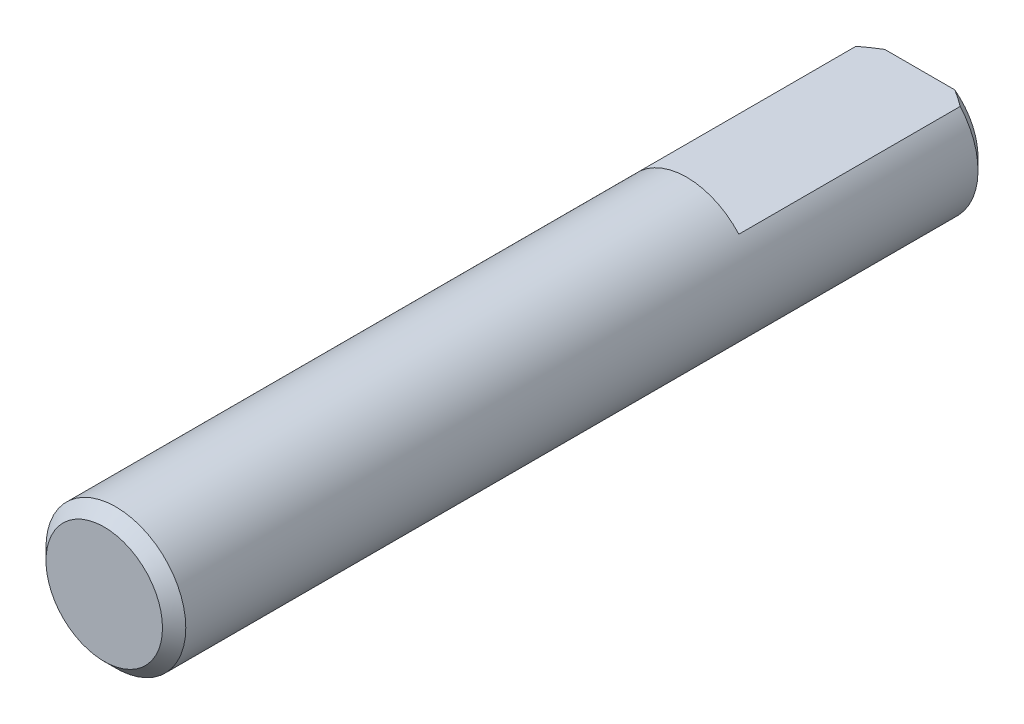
from build123d import *

# Parameters (mm, degrees)
ESQUISSE1_R             = 3
BASE_EXTRUSION_DEPTH    = 35
ENL_V_MAT_EXTRU_1_DEPTH = 10
CHANFREIN1_SIZE         = 0.5


with BuildPart() as part:
    # Esquisse1 → Base-Extrusion (new body)
    with BuildSketch(Plane.XY):
        with Locations(Location((0, 0, 0), (0, 0, 138.189685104))):
            Circle(ESQUISSE1_R)
    extrude(amount=BASE_EXTRUSION_DEPTH)

    # Esquisse2 → Enl_v. mat.-Extru.1 (cut)
    with BuildSketch(Plane(origin=(0, 0, 0), x_dir=(-1, 0, 0), z_dir=(0, 0, -1))):
        with BuildLine():
            Line((-2.236067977, 2), (2.236067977, 2))
            ThreePointArc((2.236067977, 2), (0, 3), (-2.236067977, 2))
        make_face()
    extrude(amount=-ENL_V_MAT_EXTRU_1_DEPTH, mode=Mode.SUBTRACT)

    # Chanfrein1
    chanfrein1_edges = [part.edges().sort_by_distance(p)[0] for p in [
        (0, -3, 0),
        (2.236067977, -2, 35),
    ]]
    chamfer(chanfrein1_edges, length=CHANFREIN1_SIZE)


solid = part.part
